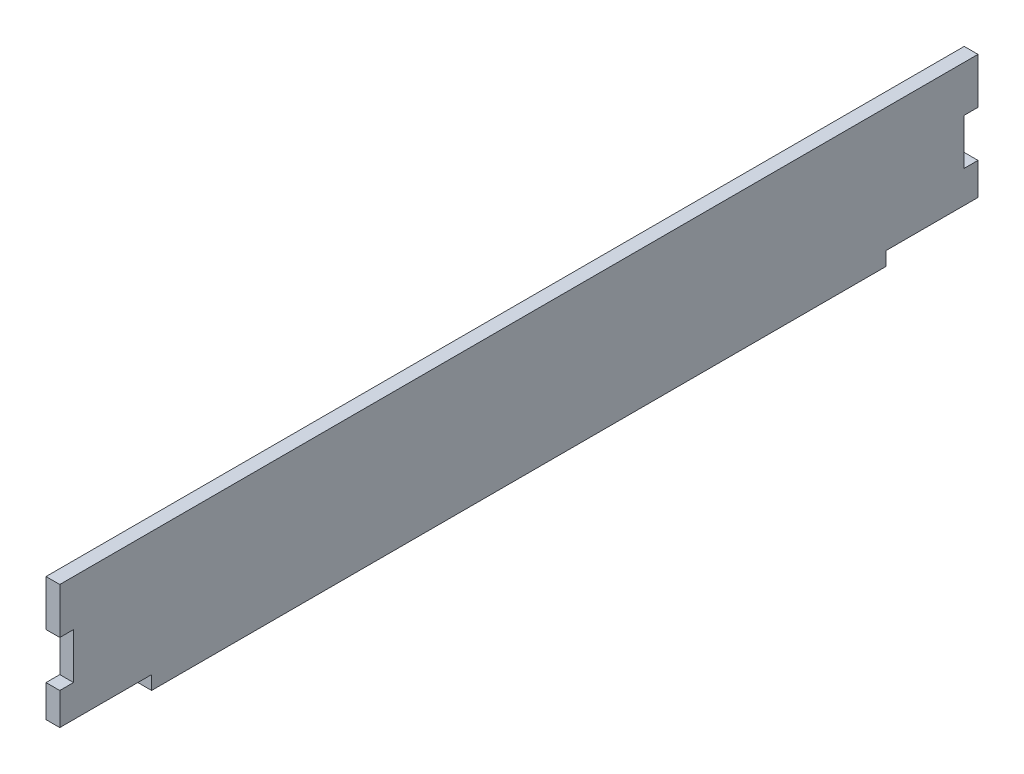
ISO-10303-21;
HEADER;
FILE_DESCRIPTION(('STEP AP214'),'2;1');
FILE_NAME('part.step','',(''),(''),'','','');
FILE_SCHEMA(('AUTOMOTIVE_DESIGN { 1 0 10303 214 1 1 1 1 }'));
ENDSEC;
DATA;
#1=APPLICATION_CONTEXT('core data for automotive mechanical design processes');
#2=APPLICATION_PROTOCOL_DEFINITION('international standard','automotive_design',2000,#1);
#3=PRODUCT_CONTEXT('',#1,'mechanical');
#4=PRODUCT('Part','Part','',(#3));
#5=PRODUCT_RELATED_PRODUCT_CATEGORY('part','',(#4));
#6=PRODUCT_DEFINITION_FORMATION('','',#4);
#7=PRODUCT_DEFINITION_CONTEXT('part definition',#1,'design');
#8=PRODUCT_DEFINITION('design','',#6,#7);
#9=PRODUCT_DEFINITION_SHAPE('','',#8);
#10=(LENGTH_UNIT() NAMED_UNIT(*) SI_UNIT(.MILLI.,.METRE.));
#11=(NAMED_UNIT(*) PLANE_ANGLE_UNIT() SI_UNIT($,.RADIAN.));
#12=(NAMED_UNIT(*) SI_UNIT($,.STERADIAN.) SOLID_ANGLE_UNIT());
#13=UNCERTAINTY_MEASURE_WITH_UNIT(LENGTH_MEASURE(1.E-05),#10,'distance_accuracy_value','');
#14=(GEOMETRIC_REPRESENTATION_CONTEXT(3) GLOBAL_UNCERTAINTY_ASSIGNED_CONTEXT((#13)) GLOBAL_UNIT_ASSIGNED_CONTEXT((#10,
#11,#12)) REPRESENTATION_CONTEXT('',''));
#15=CARTESIAN_POINT('',(0.,0.,0.));
#16=DIRECTION('',(0.,0.,1.));
#17=DIRECTION('',(1.,0.,0.));
#18=AXIS2_PLACEMENT_3D('',#15,#16,#17);
#19=CARTESIAN_POINT('',(3.,14.4036272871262,-75.8905496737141));
#20=DIRECTION('',(0.,0.,1.));
#21=DIRECTION('',(1.,0.,0.));
#22=AXIS2_PLACEMENT_3D('',#19,#20,#21);
#23=PLANE('',#22);
#24=DIRECTION('',(0.,1.,0.));
#25=VECTOR('',#24,1.);
#26=CARTESIAN_POINT('',(0.,14.4036272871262,-75.8905496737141));
#27=LINE('',#26,#25);
#28=CARTESIAN_POINT('',(0.,4.4036272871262,-75.8905496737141));
#29=VERTEX_POINT('',#28);
#30=CARTESIAN_POINT('',(0.,14.4036272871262,-75.8905496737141));
#31=VERTEX_POINT('',#30);
#32=EDGE_CURVE('E177',#29,#31,#27,.T.);
#33=ORIENTED_EDGE('',*,*,#32,.T.);
#34=DIRECTION('',(-1.,0.,0.));
#35=VECTOR('',#34,1.);
#36=CARTESIAN_POINT('',(3.,14.4036272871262,-75.8905496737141));
#37=LINE('',#36,#35);
#38=CARTESIAN_POINT('',(3.,14.4036272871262,-75.8905496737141));
#39=VERTEX_POINT('',#38);
#40=EDGE_CURVE('E11',#39,#31,#37,.T.);
#41=ORIENTED_EDGE('',*,*,#40,.F.);
#42=DIRECTION('',(0.,1.,0.));
#43=VECTOR('',#42,1.);
#44=CARTESIAN_POINT('',(3.,14.4036272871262,-75.8905496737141));
#45=LINE('',#44,#43);
#46=CARTESIAN_POINT('',(3.,4.4036272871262,-75.8905496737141));
#47=VERTEX_POINT('',#46);
#48=EDGE_CURVE('E207',#47,#39,#45,.T.);
#49=ORIENTED_EDGE('',*,*,#48,.F.);
#50=DIRECTION('',(-1.,0.,0.));
#51=VECTOR('',#50,1.);
#52=CARTESIAN_POINT('',(3.,4.4036272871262,-75.8905496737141));
#53=LINE('',#52,#51);
#54=EDGE_CURVE('E173',#47,#29,#53,.T.);
#55=ORIENTED_EDGE('',*,*,#54,.T.);
#56=EDGE_LOOP('',(#33,#41,#49,#55));
#57=FACE_BOUND('',#56,.T.);
#58=ADVANCED_FACE('F33',(#57),#23,.F.);
#59=CARTESIAN_POINT('',(3.,14.4036272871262,-75.8905496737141));
#60=DIRECTION('',(0.,-1.,0.));
#61=DIRECTION('',(0.,0.,-1.));
#62=AXIS2_PLACEMENT_3D('',#59,#60,#61);
#63=PLANE('',#62);
#64=DIRECTION('',(0.,0.,1.));
#65=VECTOR('',#64,1.);
#66=CARTESIAN_POINT('',(0.,14.4036272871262,-75.8905496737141));
#67=LINE('',#66,#65);
#68=CARTESIAN_POINT('',(0.,14.4036272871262,124.109450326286));
#69=VERTEX_POINT('',#68);
#70=EDGE_CURVE('E180',#31,#69,#67,.T.);
#71=ORIENTED_EDGE('',*,*,#70,.T.);
#72=DIRECTION('',(-1.,0.,0.));
#73=VECTOR('',#72,1.);
#74=CARTESIAN_POINT('',(3.,14.4036272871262,124.109450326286));
#75=LINE('',#74,#73);
#76=CARTESIAN_POINT('',(3.,14.4036272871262,124.109450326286));
#77=VERTEX_POINT('',#76);
#78=EDGE_CURVE('E41',#77,#69,#75,.T.);
#79=ORIENTED_EDGE('',*,*,#78,.F.);
#80=DIRECTION('',(0.,0.,1.));
#81=VECTOR('',#80,1.);
#82=CARTESIAN_POINT('',(3.,14.4036272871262,-75.8905496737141));
#83=LINE('',#82,#81);
#84=EDGE_CURVE('E116',#39,#77,#83,.T.);
#85=ORIENTED_EDGE('',*,*,#84,.F.);
#86=ORIENTED_EDGE('',*,*,#40,.T.);
#87=EDGE_LOOP('',(#71,#79,#85,#86));
#88=FACE_BOUND('',#87,.T.);
#89=ADVANCED_FACE('F305',(#88),#63,.F.);
#90=CARTESIAN_POINT('',(3.,14.4036272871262,124.109450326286));
#91=DIRECTION('',(0.,0.,-1.));
#92=DIRECTION('',(-1.,0.,0.));
#93=AXIS2_PLACEMENT_3D('',#90,#91,#92);
#94=PLANE('',#93);
#95=DIRECTION('',(0.,-1.,0.));
#96=VECTOR('',#95,1.);
#97=CARTESIAN_POINT('',(0.,14.4036272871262,124.109450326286));
#98=LINE('',#97,#96);
#99=CARTESIAN_POINT('',(0.,4.4036272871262,124.109450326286));
#100=VERTEX_POINT('',#99);
#101=EDGE_CURVE('E182',#69,#100,#98,.T.);
#102=ORIENTED_EDGE('',*,*,#101,.T.);
#103=DIRECTION('',(-1.,0.,0.));
#104=VECTOR('',#103,1.);
#105=CARTESIAN_POINT('',(3.,4.4036272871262,124.109450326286));
#106=LINE('',#105,#104);
#107=CARTESIAN_POINT('',(3.,4.4036272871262,124.109450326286));
#108=VERTEX_POINT('',#107);
#109=EDGE_CURVE('E238',#108,#100,#106,.T.);
#110=ORIENTED_EDGE('',*,*,#109,.F.);
#111=DIRECTION('',(0.,-1.,0.));
#112=VECTOR('',#111,1.);
#113=CARTESIAN_POINT('',(3.,14.4036272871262,124.109450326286));
#114=LINE('',#113,#112);
#115=EDGE_CURVE('E246',#77,#108,#114,.T.);
#116=ORIENTED_EDGE('',*,*,#115,.F.);
#117=ORIENTED_EDGE('',*,*,#78,.T.);
#118=EDGE_LOOP('',(#102,#110,#116,#117));
#119=FACE_BOUND('',#118,.T.);
#120=ADVANCED_FACE('F244',(#119),#94,.F.);
#121=CARTESIAN_POINT('',(3.,4.4036272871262,124.109450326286));
#122=DIRECTION('',(0.,1.,0.));
#123=DIRECTION('',(0.,0.,1.));
#124=AXIS2_PLACEMENT_3D('',#121,#122,#123);
#125=PLANE('',#124);
#126=DIRECTION('',(0.,0.,-1.));
#127=VECTOR('',#126,1.);
#128=CARTESIAN_POINT('',(0.,4.4036272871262,124.109450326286));
#129=LINE('',#128,#127);
#130=CARTESIAN_POINT('',(0.,4.40362728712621,121.109450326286));
#131=VERTEX_POINT('',#130);
#132=EDGE_CURVE('E184',#100,#131,#129,.T.);
#133=ORIENTED_EDGE('',*,*,#132,.T.);
#134=DIRECTION('',(-1.,0.,0.));
#135=VECTOR('',#134,1.);
#136=CARTESIAN_POINT('',(3.,4.40362728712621,121.109450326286));
#137=LINE('',#136,#135);
#138=CARTESIAN_POINT('',(3.,4.40362728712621,121.109450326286));
#139=VERTEX_POINT('',#138);
#140=EDGE_CURVE('E235',#139,#131,#137,.T.);
#141=ORIENTED_EDGE('',*,*,#140,.F.);
#142=DIRECTION('',(0.,0.,-1.));
#143=VECTOR('',#142,1.);
#144=CARTESIAN_POINT('',(3.,4.4036272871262,124.109450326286));
#145=LINE('',#144,#143);
#146=EDGE_CURVE('E264',#108,#139,#145,.T.);
#147=ORIENTED_EDGE('',*,*,#146,.F.);
#148=ORIENTED_EDGE('',*,*,#109,.T.);
#149=EDGE_LOOP('',(#133,#141,#147,#148));
#150=FACE_BOUND('',#149,.T.);
#151=ADVANCED_FACE('F255',(#150),#125,.F.);
#152=CARTESIAN_POINT('',(3.,4.40362728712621,121.109450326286));
#153=DIRECTION('',(0.,0.,-1.));
#154=DIRECTION('',(-1.,0.,0.));
#155=AXIS2_PLACEMENT_3D('',#152,#153,#154);
#156=PLANE('',#155);
#157=DIRECTION('',(0.,-1.,0.));
#158=VECTOR('',#157,1.);
#159=CARTESIAN_POINT('',(0.,4.40362728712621,121.109450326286));
#160=LINE('',#159,#158);
#161=CARTESIAN_POINT('',(0.,-5.5963727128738,121.109450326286));
#162=VERTEX_POINT('',#161);
#163=EDGE_CURVE('E186',#131,#162,#160,.T.);
#164=ORIENTED_EDGE('',*,*,#163,.T.);
#165=DIRECTION('',(-1.,0.,0.));
#166=VECTOR('',#165,1.);
#167=CARTESIAN_POINT('',(3.,-5.5963727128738,121.109450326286));
#168=LINE('',#167,#166);
#169=CARTESIAN_POINT('',(3.,-5.5963727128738,121.109450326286));
#170=VERTEX_POINT('',#169);
#171=EDGE_CURVE('E232',#170,#162,#168,.T.);
#172=ORIENTED_EDGE('',*,*,#171,.F.);
#173=DIRECTION('',(0.,-1.,0.));
#174=VECTOR('',#173,1.);
#175=CARTESIAN_POINT('',(3.,4.40362728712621,121.109450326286));
#176=LINE('',#175,#174);
#177=EDGE_CURVE('E261',#139,#170,#176,.T.);
#178=ORIENTED_EDGE('',*,*,#177,.F.);
#179=ORIENTED_EDGE('',*,*,#140,.T.);
#180=EDGE_LOOP('',(#164,#172,#178,#179));
#181=FACE_BOUND('',#180,.T.);
#182=ADVANCED_FACE('F259',(#181),#156,.F.);
#183=CARTESIAN_POINT('',(3.,-5.5963727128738,124.109450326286));
#184=DIRECTION('',(0.,-1.,0.));
#185=DIRECTION('',(0.,0.,-1.));
#186=AXIS2_PLACEMENT_3D('',#183,#184,#185);
#187=PLANE('',#186);
#188=DIRECTION('',(0.,0.,1.));
#189=VECTOR('',#188,1.);
#190=CARTESIAN_POINT('',(0.,-5.5963727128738,124.109450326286));
#191=LINE('',#190,#189);
#192=CARTESIAN_POINT('',(0.,-5.5963727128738,124.109450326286));
#193=VERTEX_POINT('',#192);
#194=EDGE_CURVE('E188',#162,#193,#191,.T.);
#195=ORIENTED_EDGE('',*,*,#194,.T.);
#196=DIRECTION('',(-1.,0.,0.));
#197=VECTOR('',#196,1.);
#198=CARTESIAN_POINT('',(3.,-5.5963727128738,124.109450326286));
#199=LINE('',#198,#197);
#200=CARTESIAN_POINT('',(3.,-5.5963727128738,124.109450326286));
#201=VERTEX_POINT('',#200);
#202=EDGE_CURVE('E229',#201,#193,#199,.T.);
#203=ORIENTED_EDGE('',*,*,#202,.F.);
#204=DIRECTION('',(0.,0.,1.));
#205=VECTOR('',#204,1.);
#206=CARTESIAN_POINT('',(3.,-5.5963727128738,124.109450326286));
#207=LINE('',#206,#205);
#208=EDGE_CURVE('E263',#170,#201,#207,.T.);
#209=ORIENTED_EDGE('',*,*,#208,.F.);
#210=ORIENTED_EDGE('',*,*,#171,.T.);
#211=EDGE_LOOP('',(#195,#203,#209,#210));
#212=FACE_BOUND('',#211,.T.);
#213=ADVANCED_FACE('F318',(#212),#187,.F.);
#214=CARTESIAN_POINT('',(3.,-5.5963727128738,124.109450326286));
#215=DIRECTION('',(0.,0.,-1.));
#216=DIRECTION('',(-1.,0.,0.));
#217=AXIS2_PLACEMENT_3D('',#214,#215,#216);
#218=PLANE('',#217);
#219=DIRECTION('',(0.,-1.,0.));
#220=VECTOR('',#219,1.);
#221=CARTESIAN_POINT('',(0.,-5.5963727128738,124.109450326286));
#222=LINE('',#221,#220);
#223=CARTESIAN_POINT('',(0.,-12.5963727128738,124.109450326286));
#224=VERTEX_POINT('',#223);
#225=EDGE_CURVE('E190',#193,#224,#222,.T.);
#226=ORIENTED_EDGE('',*,*,#225,.T.);
#227=DIRECTION('',(-1.,0.,0.));
#228=VECTOR('',#227,1.);
#229=CARTESIAN_POINT('',(3.,-12.5963727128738,124.109450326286));
#230=LINE('',#229,#228);
#231=CARTESIAN_POINT('',(3.,-12.5963727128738,124.109450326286));
#232=VERTEX_POINT('',#231);
#233=EDGE_CURVE('E226',#232,#224,#230,.T.);
#234=ORIENTED_EDGE('',*,*,#233,.F.);
#235=DIRECTION('',(0.,-1.,0.));
#236=VECTOR('',#235,1.);
#237=CARTESIAN_POINT('',(3.,-5.5963727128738,124.109450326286));
#238=LINE('',#237,#236);
#239=EDGE_CURVE('E266',#201,#232,#238,.T.);
#240=ORIENTED_EDGE('',*,*,#239,.F.);
#241=ORIENTED_EDGE('',*,*,#202,.T.);
#242=EDGE_LOOP('',(#226,#234,#240,#241));
#243=FACE_BOUND('',#242,.T.);
#244=ADVANCED_FACE('F321',(#243),#218,.F.);
#245=CARTESIAN_POINT('',(3.,-12.5963727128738,104.109450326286));
#246=DIRECTION('',(0.,1.,0.));
#247=DIRECTION('',(0.,0.,1.));
#248=AXIS2_PLACEMENT_3D('',#245,#246,#247);
#249=PLANE('',#248);
#250=DIRECTION('',(0.,0.,-1.));
#251=VECTOR('',#250,1.);
#252=CARTESIAN_POINT('',(0.,-12.5963727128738,104.109450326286));
#253=LINE('',#252,#251);
#254=CARTESIAN_POINT('',(0.,-12.5963727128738,104.109450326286));
#255=VERTEX_POINT('',#254);
#256=EDGE_CURVE('E192',#224,#255,#253,.T.);
#257=ORIENTED_EDGE('',*,*,#256,.T.);
#258=DIRECTION('',(-1.,0.,0.));
#259=VECTOR('',#258,1.);
#260=CARTESIAN_POINT('',(3.,-12.5963727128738,104.109450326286));
#261=LINE('',#260,#259);
#262=CARTESIAN_POINT('',(3.,-12.5963727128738,104.109450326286));
#263=VERTEX_POINT('',#262);
#264=EDGE_CURVE('E223',#263,#255,#261,.T.);
#265=ORIENTED_EDGE('',*,*,#264,.F.);
#266=DIRECTION('',(0.,0.,-1.));
#267=VECTOR('',#266,1.);
#268=CARTESIAN_POINT('',(3.,-12.5963727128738,104.109450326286));
#269=LINE('',#268,#267);
#270=EDGE_CURVE('E272',#232,#263,#269,.T.);
#271=ORIENTED_EDGE('',*,*,#270,.F.);
#272=ORIENTED_EDGE('',*,*,#233,.T.);
#273=EDGE_LOOP('',(#257,#265,#271,#272));
#274=FACE_BOUND('',#273,.T.);
#275=ADVANCED_FACE('F325',(#274),#249,.F.);
#276=CARTESIAN_POINT('',(3.,-15.5963727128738,104.109450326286));
#277=DIRECTION('',(0.,0.,-1.));
#278=DIRECTION('',(-1.,0.,0.));
#279=AXIS2_PLACEMENT_3D('',#276,#277,#278);
#280=PLANE('',#279);
#281=DIRECTION('',(0.,-1.,0.));
#282=VECTOR('',#281,1.);
#283=CARTESIAN_POINT('',(0.,-15.5963727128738,104.109450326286));
#284=LINE('',#283,#282);
#285=CARTESIAN_POINT('',(0.,-15.5963727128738,104.109450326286));
#286=VERTEX_POINT('',#285);
#287=EDGE_CURVE('E194',#255,#286,#284,.T.);
#288=ORIENTED_EDGE('',*,*,#287,.T.);
#289=DIRECTION('',(-1.,0.,0.));
#290=VECTOR('',#289,1.);
#291=CARTESIAN_POINT('',(3.,-15.5963727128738,104.109450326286));
#292=LINE('',#291,#290);
#293=CARTESIAN_POINT('',(3.,-15.5963727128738,104.109450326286));
#294=VERTEX_POINT('',#293);
#295=EDGE_CURVE('E220',#294,#286,#292,.T.);
#296=ORIENTED_EDGE('',*,*,#295,.F.);
#297=DIRECTION('',(0.,-1.,0.));
#298=VECTOR('',#297,1.);
#299=CARTESIAN_POINT('',(3.,-15.5963727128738,104.109450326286));
#300=LINE('',#299,#298);
#301=EDGE_CURVE('E274',#263,#294,#300,.T.);
#302=ORIENTED_EDGE('',*,*,#301,.F.);
#303=ORIENTED_EDGE('',*,*,#264,.T.);
#304=EDGE_LOOP('',(#288,#296,#302,#303));
#305=FACE_BOUND('',#304,.T.);
#306=ADVANCED_FACE('F329',(#305),#280,.F.);
#307=CARTESIAN_POINT('',(3.,-15.5963727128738,104.109450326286));
#308=DIRECTION('',(0.,1.,0.));
#309=DIRECTION('',(0.,0.,1.));
#310=AXIS2_PLACEMENT_3D('',#307,#308,#309);
#311=PLANE('',#310);
#312=DIRECTION('',(0.,0.,-1.));
#313=VECTOR('',#312,1.);
#314=CARTESIAN_POINT('',(0.,-15.5963727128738,104.109450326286));
#315=LINE('',#314,#313);
#316=CARTESIAN_POINT('',(0.,-15.5963727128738,-55.8905496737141));
#317=VERTEX_POINT('',#316);
#318=EDGE_CURVE('E196',#286,#317,#315,.T.);
#319=ORIENTED_EDGE('',*,*,#318,.T.);
#320=DIRECTION('',(-1.,0.,0.));
#321=VECTOR('',#320,1.);
#322=CARTESIAN_POINT('',(3.,-15.5963727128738,-55.8905496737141));
#323=LINE('',#322,#321);
#324=CARTESIAN_POINT('',(3.,-15.5963727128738,-55.8905496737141));
#325=VERTEX_POINT('',#324);
#326=EDGE_CURVE('E217',#325,#317,#323,.T.);
#327=ORIENTED_EDGE('',*,*,#326,.F.);
#328=DIRECTION('',(0.,0.,-1.));
#329=VECTOR('',#328,1.);
#330=CARTESIAN_POINT('',(3.,-15.5963727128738,104.109450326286));
#331=LINE('',#330,#329);
#332=EDGE_CURVE('E276',#294,#325,#331,.T.);
#333=ORIENTED_EDGE('',*,*,#332,.F.);
#334=ORIENTED_EDGE('',*,*,#295,.T.);
#335=EDGE_LOOP('',(#319,#327,#333,#334));
#336=FACE_BOUND('',#335,.T.);
#337=ADVANCED_FACE('F333',(#336),#311,.F.);
#338=CARTESIAN_POINT('',(3.,-15.5963727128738,-55.8905496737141));
#339=DIRECTION('',(0.,0.,1.));
#340=DIRECTION('',(1.,0.,0.));
#341=AXIS2_PLACEMENT_3D('',#338,#339,#340);
#342=PLANE('',#341);
#343=DIRECTION('',(0.,1.,0.));
#344=VECTOR('',#343,1.);
#345=CARTESIAN_POINT('',(0.,-15.5963727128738,-55.8905496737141));
#346=LINE('',#345,#344);
#347=CARTESIAN_POINT('',(0.,-12.5963727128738,-55.8905496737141));
#348=VERTEX_POINT('',#347);
#349=EDGE_CURVE('E198',#317,#348,#346,.T.);
#350=ORIENTED_EDGE('',*,*,#349,.T.);
#351=DIRECTION('',(-1.,0.,0.));
#352=VECTOR('',#351,1.);
#353=CARTESIAN_POINT('',(3.,-12.5963727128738,-55.8905496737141));
#354=LINE('',#353,#352);
#355=CARTESIAN_POINT('',(3.,-12.5963727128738,-55.8905496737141));
#356=VERTEX_POINT('',#355);
#357=EDGE_CURVE('E214',#356,#348,#354,.T.);
#358=ORIENTED_EDGE('',*,*,#357,.F.);
#359=DIRECTION('',(0.,1.,0.));
#360=VECTOR('',#359,1.);
#361=CARTESIAN_POINT('',(3.,-15.5963727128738,-55.8905496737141));
#362=LINE('',#361,#360);
#363=EDGE_CURVE('E278',#325,#356,#362,.T.);
#364=ORIENTED_EDGE('',*,*,#363,.F.);
#365=ORIENTED_EDGE('',*,*,#326,.T.);
#366=EDGE_LOOP('',(#350,#358,#364,#365));
#367=FACE_BOUND('',#366,.T.);
#368=ADVANCED_FACE('F337',(#367),#342,.F.);
#369=CARTESIAN_POINT('',(3.,-12.5963727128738,-75.8905496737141));
#370=DIRECTION('',(0.,1.,0.));
#371=DIRECTION('',(0.,0.,1.));
#372=AXIS2_PLACEMENT_3D('',#369,#370,#371);
#373=PLANE('',#372);
#374=DIRECTION('',(0.,0.,-1.));
#375=VECTOR('',#374,1.);
#376=CARTESIAN_POINT('',(0.,-12.5963727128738,-75.8905496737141));
#377=LINE('',#376,#375);
#378=CARTESIAN_POINT('',(0.,-12.5963727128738,-75.8905496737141));
#379=VERTEX_POINT('',#378);
#380=EDGE_CURVE('E200',#348,#379,#377,.T.);
#381=ORIENTED_EDGE('',*,*,#380,.T.);
#382=DIRECTION('',(-1.,0.,0.));
#383=VECTOR('',#382,1.);
#384=CARTESIAN_POINT('',(3.,-12.5963727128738,-75.8905496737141));
#385=LINE('',#384,#383);
#386=CARTESIAN_POINT('',(3.,-12.5963727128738,-75.8905496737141));
#387=VERTEX_POINT('',#386);
#388=EDGE_CURVE('E211',#387,#379,#385,.T.);
#389=ORIENTED_EDGE('',*,*,#388,.F.);
#390=DIRECTION('',(0.,0.,-1.));
#391=VECTOR('',#390,1.);
#392=CARTESIAN_POINT('',(3.,-12.5963727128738,-75.8905496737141));
#393=LINE('',#392,#391);
#394=EDGE_CURVE('E280',#356,#387,#393,.T.);
#395=ORIENTED_EDGE('',*,*,#394,.F.);
#396=ORIENTED_EDGE('',*,*,#357,.T.);
#397=EDGE_LOOP('',(#381,#389,#395,#396));
#398=FACE_BOUND('',#397,.T.);
#399=ADVANCED_FACE('F286',(#398),#373,.F.);
#400=CARTESIAN_POINT('',(3.,-5.5963727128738,-75.8905496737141));
#401=DIRECTION('',(0.,0.,1.));
#402=DIRECTION('',(1.,0.,0.));
#403=AXIS2_PLACEMENT_3D('',#400,#401,#402);
#404=PLANE('',#403);
#405=DIRECTION('',(0.,1.,0.));
#406=VECTOR('',#405,1.);
#407=CARTESIAN_POINT('',(0.,-5.5963727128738,-75.8905496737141));
#408=LINE('',#407,#406);
#409=CARTESIAN_POINT('',(0.,-5.5963727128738,-75.8905496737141));
#410=VERTEX_POINT('',#409);
#411=EDGE_CURVE('E202',#379,#410,#408,.T.);
#412=ORIENTED_EDGE('',*,*,#411,.T.);
#413=DIRECTION('',(-1.,0.,0.));
#414=VECTOR('',#413,1.);
#415=CARTESIAN_POINT('',(3.,-5.5963727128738,-75.8905496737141));
#416=LINE('',#415,#414);
#417=CARTESIAN_POINT('',(3.,-5.5963727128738,-75.8905496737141));
#418=VERTEX_POINT('',#417);
#419=EDGE_CURVE('E168',#418,#410,#416,.T.);
#420=ORIENTED_EDGE('',*,*,#419,.F.);
#421=DIRECTION('',(0.,1.,0.));
#422=VECTOR('',#421,1.);
#423=CARTESIAN_POINT('',(3.,-5.5963727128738,-75.8905496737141));
#424=LINE('',#423,#422);
#425=EDGE_CURVE('E159',#387,#418,#424,.T.);
#426=ORIENTED_EDGE('',*,*,#425,.F.);
#427=ORIENTED_EDGE('',*,*,#388,.T.);
#428=EDGE_LOOP('',(#412,#420,#426,#427));
#429=FACE_BOUND('',#428,.T.);
#430=ADVANCED_FACE('F290',(#429),#404,.F.);
#431=CARTESIAN_POINT('',(3.,-5.59637271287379,-72.8905496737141));
#432=DIRECTION('',(0.,-1.,0.));
#433=DIRECTION('',(0.,0.,-1.));
#434=AXIS2_PLACEMENT_3D('',#431,#432,#433);
#435=PLANE('',#434);
#436=DIRECTION('',(0.,0.,1.));
#437=VECTOR('',#436,1.);
#438=CARTESIAN_POINT('',(0.,-5.59637271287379,-72.8905496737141));
#439=LINE('',#438,#437);
#440=CARTESIAN_POINT('',(0.,-5.59637271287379,-72.8905496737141));
#441=VERTEX_POINT('',#440);
#442=EDGE_CURVE('E167',#410,#441,#439,.T.);
#443=ORIENTED_EDGE('',*,*,#442,.T.);
#444=DIRECTION('',(-1.,0.,0.));
#445=VECTOR('',#444,1.);
#446=CARTESIAN_POINT('',(3.,-5.59637271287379,-72.8905496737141));
#447=LINE('',#446,#445);
#448=CARTESIAN_POINT('',(3.,-5.59637271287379,-72.8905496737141));
#449=VERTEX_POINT('',#448);
#450=EDGE_CURVE('E164',#449,#441,#447,.T.);
#451=ORIENTED_EDGE('',*,*,#450,.F.);
#452=DIRECTION('',(0.,0.,1.));
#453=VECTOR('',#452,1.);
#454=CARTESIAN_POINT('',(3.,-5.59637271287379,-72.8905496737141));
#455=LINE('',#454,#453);
#456=EDGE_CURVE('E153',#418,#449,#455,.T.);
#457=ORIENTED_EDGE('',*,*,#456,.F.);
#458=ORIENTED_EDGE('',*,*,#419,.T.);
#459=EDGE_LOOP('',(#443,#451,#457,#458));
#460=FACE_BOUND('',#459,.T.);
#461=ADVANCED_FACE('F165',(#460),#435,.F.);
#462=CARTESIAN_POINT('',(3.,4.40362728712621,-72.8905496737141));
#463=DIRECTION('',(0.,0.,1.));
#464=DIRECTION('',(1.,0.,0.));
#465=AXIS2_PLACEMENT_3D('',#462,#463,#464);
#466=PLANE('',#465);
#467=DIRECTION('',(0.,1.,0.));
#468=VECTOR('',#467,1.);
#469=CARTESIAN_POINT('',(0.,4.40362728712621,-72.8905496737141));
#470=LINE('',#469,#468);
#471=CARTESIAN_POINT('',(0.,4.40362728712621,-72.8905496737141));
#472=VERTEX_POINT('',#471);
#473=EDGE_CURVE('E102',#441,#472,#470,.T.);
#474=ORIENTED_EDGE('',*,*,#473,.T.);
#475=DIRECTION('',(-1.,0.,0.));
#476=VECTOR('',#475,1.);
#477=CARTESIAN_POINT('',(3.,4.40362728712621,-72.8905496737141));
#478=LINE('',#477,#476);
#479=CARTESIAN_POINT('',(3.,4.40362728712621,-72.8905496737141));
#480=VERTEX_POINT('',#479);
#481=EDGE_CURVE('E169',#480,#472,#478,.T.);
#482=ORIENTED_EDGE('',*,*,#481,.F.);
#483=DIRECTION('',(0.,1.,0.));
#484=VECTOR('',#483,1.);
#485=CARTESIAN_POINT('',(3.,4.40362728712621,-72.8905496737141));
#486=LINE('',#485,#484);
#487=EDGE_CURVE('E157',#449,#480,#486,.T.);
#488=ORIENTED_EDGE('',*,*,#487,.F.);
#489=ORIENTED_EDGE('',*,*,#450,.T.);
#490=EDGE_LOOP('',(#474,#482,#488,#489));
#491=FACE_BOUND('',#490,.T.);
#492=ADVANCED_FACE('F171',(#491),#466,.F.);
#493=CARTESIAN_POINT('',(3.,4.40362728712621,-72.8905496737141));
#494=DIRECTION('',(0.,1.,0.));
#495=DIRECTION('',(0.,0.,1.));
#496=AXIS2_PLACEMENT_3D('',#493,#494,#495);
#497=PLANE('',#496);
#498=DIRECTION('',(0.,0.,-1.));
#499=VECTOR('',#498,1.);
#500=CARTESIAN_POINT('',(0.,4.40362728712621,-72.8905496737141));
#501=LINE('',#500,#499);
#502=EDGE_CURVE('E108',#472,#29,#501,.T.);
#503=ORIENTED_EDGE('',*,*,#502,.T.);
#504=ORIENTED_EDGE('',*,*,#54,.F.);
#505=DIRECTION('',(0.,0.,-1.));
#506=VECTOR('',#505,1.);
#507=CARTESIAN_POINT('',(3.,4.40362728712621,-72.8905496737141));
#508=LINE('',#507,#506);
#509=EDGE_CURVE('E49',#480,#47,#508,.T.);
#510=ORIENTED_EDGE('',*,*,#509,.F.);
#511=ORIENTED_EDGE('',*,*,#481,.T.);
#512=EDGE_LOOP('',(#503,#504,#510,#511));
#513=FACE_BOUND('',#512,.T.);
#514=ADVANCED_FACE('F294',(#513),#497,.F.);
#515=CARTESIAN_POINT('',(3.,4.4036272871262,-75.8905496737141));
#516=DIRECTION('',(1.,0.,0.));
#517=DIRECTION('',(0.,0.,-1.));
#518=AXIS2_PLACEMENT_3D('',#515,#516,#517);
#519=PLANE('',#518);
#520=ORIENTED_EDGE('',*,*,#48,.T.);
#521=ORIENTED_EDGE('',*,*,#84,.T.);
#522=ORIENTED_EDGE('',*,*,#115,.T.);
#523=ORIENTED_EDGE('',*,*,#146,.T.);
#524=ORIENTED_EDGE('',*,*,#177,.T.);
#525=ORIENTED_EDGE('',*,*,#208,.T.);
#526=ORIENTED_EDGE('',*,*,#239,.T.);
#527=ORIENTED_EDGE('',*,*,#270,.T.);
#528=ORIENTED_EDGE('',*,*,#301,.T.);
#529=ORIENTED_EDGE('',*,*,#332,.T.);
#530=ORIENTED_EDGE('',*,*,#363,.T.);
#531=ORIENTED_EDGE('',*,*,#394,.T.);
#532=ORIENTED_EDGE('',*,*,#425,.T.);
#533=ORIENTED_EDGE('',*,*,#456,.T.);
#534=ORIENTED_EDGE('',*,*,#487,.T.);
#535=ORIENTED_EDGE('',*,*,#509,.T.);
#536=EDGE_LOOP('',(#520,#521,#522,#523,#524,#525,#526,#527,#528,#529,#530,#531,#532,#533,#534,#535));
#537=FACE_BOUND('',#536,.T.);
#538=ADVANCED_FACE('F155',(#537),#519,.T.);
#539=CARTESIAN_POINT('',(0.,4.4036272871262,-75.8905496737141));
#540=DIRECTION('',(1.,0.,0.));
#541=DIRECTION('',(0.,0.,-1.));
#542=AXIS2_PLACEMENT_3D('',#539,#540,#541);
#543=PLANE('',#542);
#544=ORIENTED_EDGE('',*,*,#32,.F.);
#545=ORIENTED_EDGE('',*,*,#502,.F.);
#546=ORIENTED_EDGE('',*,*,#473,.F.);
#547=ORIENTED_EDGE('',*,*,#442,.F.);
#548=ORIENTED_EDGE('',*,*,#411,.F.);
#549=ORIENTED_EDGE('',*,*,#380,.F.);
#550=ORIENTED_EDGE('',*,*,#349,.F.);
#551=ORIENTED_EDGE('',*,*,#318,.F.);
#552=ORIENTED_EDGE('',*,*,#287,.F.);
#553=ORIENTED_EDGE('',*,*,#256,.F.);
#554=ORIENTED_EDGE('',*,*,#225,.F.);
#555=ORIENTED_EDGE('',*,*,#194,.F.);
#556=ORIENTED_EDGE('',*,*,#163,.F.);
#557=ORIENTED_EDGE('',*,*,#132,.F.);
#558=ORIENTED_EDGE('',*,*,#101,.F.);
#559=ORIENTED_EDGE('',*,*,#70,.F.);
#560=EDGE_LOOP('',(#544,#545,#546,#547,#548,#549,#550,#551,#552,#553,#554,#555,#556,#557,#558,#559));
#561=FACE_BOUND('',#560,.T.);
#562=ADVANCED_FACE('F250',(#561),#543,.F.);
#563=CLOSED_SHELL('',(#58,#89,#120,#151,#182,#213,#244,#275,#306,#337,#368,#399,#430,#461,#492,
#514,#538,#562));
#564=MANIFOLD_SOLID_BREP('B2',#563);
#565=ADVANCED_BREP_SHAPE_REPRESENTATION('',(#18,#564),#14);
#566=SHAPE_DEFINITION_REPRESENTATION(#9,#565);
ENDSEC;
END-ISO-10303-21;
